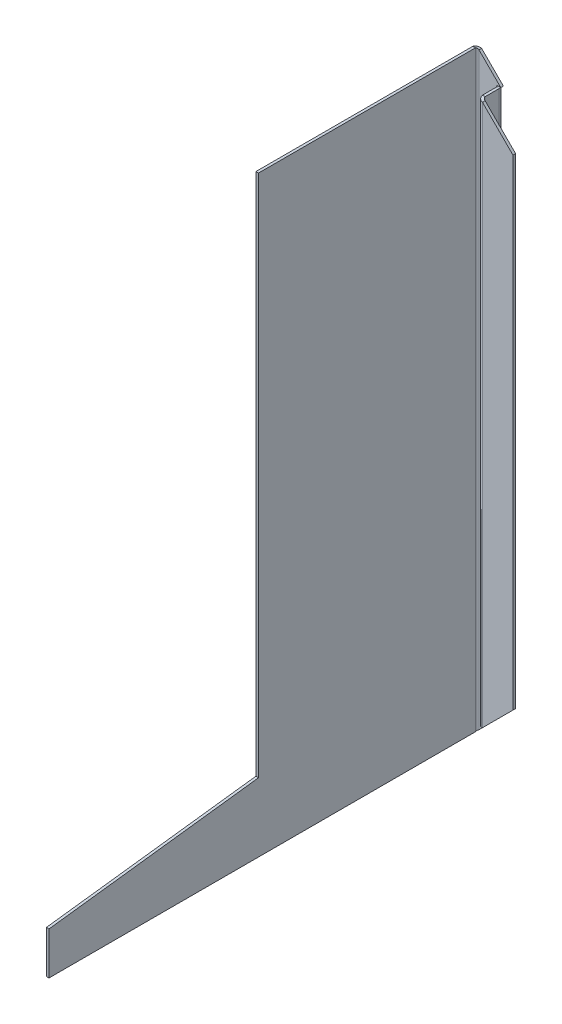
ISO-10303-21;
HEADER;
FILE_DESCRIPTION(('STEP AP214'),'2;1');
FILE_NAME('part.step','',(''),(''),'','','');
FILE_SCHEMA(('AUTOMOTIVE_DESIGN { 1 0 10303 214 1 1 1 1 }'));
ENDSEC;
DATA;
#1=APPLICATION_CONTEXT('core data for automotive mechanical design processes');
#2=APPLICATION_PROTOCOL_DEFINITION('international standard','automotive_design',2000,#1);
#3=PRODUCT_CONTEXT('',#1,'mechanical');
#4=PRODUCT('Part','Part','',(#3));
#5=PRODUCT_RELATED_PRODUCT_CATEGORY('part','',(#4));
#6=PRODUCT_DEFINITION_FORMATION('','',#4);
#7=PRODUCT_DEFINITION_CONTEXT('part definition',#1,'design');
#8=PRODUCT_DEFINITION('design','',#6,#7);
#9=PRODUCT_DEFINITION_SHAPE('','',#8);
#10=(LENGTH_UNIT() NAMED_UNIT(*) SI_UNIT(.MILLI.,.METRE.));
#11=(NAMED_UNIT(*) PLANE_ANGLE_UNIT() SI_UNIT($,.RADIAN.));
#12=(NAMED_UNIT(*) SI_UNIT($,.STERADIAN.) SOLID_ANGLE_UNIT());
#13=UNCERTAINTY_MEASURE_WITH_UNIT(LENGTH_MEASURE(1.E-05),#10,'distance_accuracy_value','');
#14=(GEOMETRIC_REPRESENTATION_CONTEXT(3) GLOBAL_UNCERTAINTY_ASSIGNED_CONTEXT((#13)) GLOBAL_UNIT_ASSIGNED_CONTEXT((#10,
#11,#12)) REPRESENTATION_CONTEXT('',''));
#15=CARTESIAN_POINT('',(0.,0.,0.));
#16=DIRECTION('',(0.,0.,1.));
#17=DIRECTION('',(1.,0.,0.));
#18=AXIS2_PLACEMENT_3D('',#15,#16,#17);
#19=CARTESIAN_POINT('',(13.5000000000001,325.75,-234.5));
#20=DIRECTION('',(0.,-1.,0.));
#21=DIRECTION('',(1.,0.,0.));
#22=AXIS2_PLACEMENT_3D('',#19,#20,#21);
#23=PLANE('',#22);
#24=DIRECTION('',(-1.,0.,0.));
#25=VECTOR('',#24,1.);
#26=CARTESIAN_POINT('',(13.5,325.75,-237.));
#27=LINE('',#26,#25);
#28=CARTESIAN_POINT('',(13.5,325.75,-237.));
#29=VERTEX_POINT('',#28);
#30=CARTESIAN_POINT('',(12.0000000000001,325.75,-237.));
#31=VERTEX_POINT('',#30);
#32=EDGE_CURVE('E299',#29,#31,#27,.T.);
#33=ORIENTED_EDGE('',*,*,#32,.F.);
#34=DIRECTION('',(0.,0.,1.));
#35=VECTOR('',#34,1.);
#36=CARTESIAN_POINT('',(13.5,325.75,-246.));
#37=LINE('',#36,#35);
#38=CARTESIAN_POINT('',(13.5,325.75,-245.));
#39=VERTEX_POINT('',#38);
#40=EDGE_CURVE('E646',#39,#29,#37,.T.);
#41=ORIENTED_EDGE('',*,*,#40,.F.);
#42=DIRECTION('',(-1.,0.,0.));
#43=VECTOR('',#42,1.);
#44=CARTESIAN_POINT('',(12.,325.75,-245.));
#45=LINE('',#44,#43);
#46=CARTESIAN_POINT('',(12.,325.75,-245.));
#47=VERTEX_POINT('',#46);
#48=EDGE_CURVE('E608',#47,#39,#45,.F.);
#49=ORIENTED_EDGE('',*,*,#48,.F.);
#50=DIRECTION('',(0.,0.,-1.));
#51=VECTOR('',#50,1.);
#52=CARTESIAN_POINT('',(12.0000000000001,325.75,-234.5));
#53=LINE('',#52,#51);
#54=EDGE_CURVE('E634',#47,#31,#53,.F.);
#55=ORIENTED_EDGE('',*,*,#54,.T.);
#56=EDGE_LOOP('',(#33,#41,#49,#55));
#57=FACE_BOUND('',#56,.T.);
#58=ADVANCED_FACE('F101',(#57),#23,.F.);
#59=CARTESIAN_POINT('',(13.5,13.5000000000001,-246.));
#60=DIRECTION('',(0.,1.,0.));
#61=DIRECTION('',(0.,0.,1.));
#62=AXIS2_PLACEMENT_3D('',#59,#60,#61);
#63=PLANE('',#62);
#64=DIRECTION('',(-1.,0.,0.));
#65=VECTOR('',#64,1.);
#66=CARTESIAN_POINT('',(13.5,13.5000000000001,-237.));
#67=LINE('',#66,#65);
#68=CARTESIAN_POINT('',(13.5,13.5000000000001,-237.));
#69=VERTEX_POINT('',#68);
#70=CARTESIAN_POINT('',(12.,13.5000000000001,-237.));
#71=VERTEX_POINT('',#70);
#72=EDGE_CURVE('E302',#69,#71,#67,.T.);
#73=ORIENTED_EDGE('',*,*,#72,.T.);
#74=DIRECTION('',(0.,0.,1.));
#75=VECTOR('',#74,1.);
#76=CARTESIAN_POINT('',(12.,13.5000000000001,-246.));
#77=LINE('',#76,#75);
#78=CARTESIAN_POINT('',(12.,13.5000000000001,-245.));
#79=VERTEX_POINT('',#78);
#80=EDGE_CURVE('E638',#71,#79,#77,.F.);
#81=ORIENTED_EDGE('',*,*,#80,.T.);
#82=DIRECTION('',(-1.,0.,0.));
#83=VECTOR('',#82,1.);
#84=CARTESIAN_POINT('',(13.5,13.5000000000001,-245.));
#85=LINE('',#84,#83);
#86=CARTESIAN_POINT('',(13.5,13.5000000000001,-245.));
#87=VERTEX_POINT('',#86);
#88=EDGE_CURVE('E301',#79,#87,#85,.F.);
#89=ORIENTED_EDGE('',*,*,#88,.T.);
#90=DIRECTION('',(0.,0.,-1.));
#91=VECTOR('',#90,1.);
#92=CARTESIAN_POINT('',(13.5,13.5000000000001,-246.));
#93=LINE('',#92,#91);
#94=EDGE_CURVE('E343',#69,#87,#93,.T.);
#95=ORIENTED_EDGE('',*,*,#94,.F.);
#96=EDGE_LOOP('',(#73,#81,#89,#95));
#97=FACE_BOUND('',#96,.T.);
#98=ADVANCED_FACE('F361',(#97),#63,.F.);
#99=CARTESIAN_POINT('',(13.5,325.75,-246.));
#100=DIRECTION('',(-1.,0.,0.));
#101=DIRECTION('',(0.,0.,1.));
#102=AXIS2_PLACEMENT_3D('',#99,#100,#101);
#103=PLANE('',#102);
#104=DIRECTION('',(0.,-1.,0.));
#105=VECTOR('',#104,1.);
#106=CARTESIAN_POINT('',(13.5,13.5000000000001,-237.));
#107=LINE('',#106,#105);
#108=EDGE_CURVE('E291',#69,#29,#107,.F.);
#109=ORIENTED_EDGE('',*,*,#108,.F.);
#110=ORIENTED_EDGE('',*,*,#94,.T.);
#111=DIRECTION('',(0.,1.,0.));
#112=VECTOR('',#111,1.);
#113=CARTESIAN_POINT('',(13.5,13.5000000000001,-245.));
#114=LINE('',#113,#112);
#115=EDGE_CURVE('E631',#39,#87,#114,.F.);
#116=ORIENTED_EDGE('',*,*,#115,.F.);
#117=ORIENTED_EDGE('',*,*,#40,.T.);
#118=EDGE_LOOP('',(#109,#110,#116,#117));
#119=FACE_BOUND('',#118,.T.);
#120=ADVANCED_FACE('F351',(#119),#103,.F.);
#121=CARTESIAN_POINT('',(12.,325.75,-246.));
#122=DIRECTION('',(-1.,0.,0.));
#123=DIRECTION('',(0.,0.,1.));
#124=AXIS2_PLACEMENT_3D('',#121,#122,#123);
#125=PLANE('',#124);
#126=ORIENTED_EDGE('',*,*,#80,.F.);
#127=DIRECTION('',(0.,-1.,0.));
#128=VECTOR('',#127,1.);
#129=CARTESIAN_POINT('',(12.,13.5000000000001,-237.));
#130=LINE('',#129,#128);
#131=EDGE_CURVE('E295',#71,#31,#130,.F.);
#132=ORIENTED_EDGE('',*,*,#131,.T.);
#133=ORIENTED_EDGE('',*,*,#54,.F.);
#134=DIRECTION('',(0.,1.,0.));
#135=VECTOR('',#134,1.);
#136=CARTESIAN_POINT('',(12.,13.5000000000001,-245.));
#137=LINE('',#136,#135);
#138=EDGE_CURVE('E639',#79,#47,#137,.T.);
#139=ORIENTED_EDGE('',*,*,#138,.F.);
#140=EDGE_LOOP('',(#126,#132,#133,#139));
#141=FACE_BOUND('',#140,.T.);
#142=ADVANCED_FACE('F360',(#141),#125,.T.);
#143=CARTESIAN_POINT('',(13.5,325.75,-246.));
#144=DIRECTION('',(0.,-1.,0.));
#145=DIRECTION('',(0.,0.,-1.));
#146=AXIS2_PLACEMENT_3D('',#143,#144,#145);
#147=PLANE('',#146);
#148=DIRECTION('',(-1.,0.,0.));
#149=VECTOR('',#148,1.);
#150=CARTESIAN_POINT('',(13.5,325.75,-246.));
#151=LINE('',#150,#149);
#152=CARTESIAN_POINT('',(13.5,325.75,-246.));
#153=VERTEX_POINT('',#152);
#154=CARTESIAN_POINT('',(13.2912878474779,325.75,-246.));
#155=VERTEX_POINT('',#154);
#156=EDGE_CURVE('E575',#153,#155,#151,.T.);
#157=ORIENTED_EDGE('',*,*,#156,.T.);
#158=CARTESIAN_POINT('',(11.,325.75,-245.));
#159=DIRECTION('',(0.,1.,0.));
#160=DIRECTION('',(0.,0.,1.));
#161=AXIS2_PLACEMENT_3D('',#158,#159,#160);
#162=CIRCLE('',#161,2.49999999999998);
#163=CARTESIAN_POINT('',(11.,325.75,-247.5));
#164=VERTEX_POINT('',#163);
#165=EDGE_CURVE('E13',#155,#164,#162,.T.);
#166=ORIENTED_EDGE('',*,*,#165,.T.);
#167=DIRECTION('',(1.,0.,0.));
#168=VECTOR('',#167,1.);
#169=CARTESIAN_POINT('',(0.,325.75,-247.5));
#170=LINE('',#169,#168);
#171=CARTESIAN_POINT('',(13.5,325.75,-247.5));
#172=VERTEX_POINT('',#171);
#173=EDGE_CURVE('E582',#164,#172,#170,.T.);
#174=ORIENTED_EDGE('',*,*,#173,.T.);
#175=DIRECTION('',(0.,0.,1.));
#176=VECTOR('',#175,1.);
#177=CARTESIAN_POINT('',(13.5,325.75,-247.5));
#178=LINE('',#177,#176);
#179=EDGE_CURVE('E467',#172,#153,#178,.T.);
#180=ORIENTED_EDGE('',*,*,#179,.T.);
#181=EDGE_LOOP('',(#157,#166,#174,#180));
#182=FACE_BOUND('',#181,.T.);
#183=ADVANCED_FACE('F365',(#182),#147,.T.);
#184=CARTESIAN_POINT('',(11.,13.5000000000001,-246.));
#185=DIRECTION('',(0.,1.,0.));
#186=DIRECTION('',(0.,0.,1.));
#187=AXIS2_PLACEMENT_3D('',#184,#185,#186);
#188=PLANE('',#187);
#189=DIRECTION('',(-1.,0.,0.));
#190=VECTOR('',#189,1.);
#191=CARTESIAN_POINT('',(-1.81351297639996E-12,13.5000000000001,-247.5));
#192=LINE('',#191,#190);
#193=CARTESIAN_POINT('',(13.5,13.5000000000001,-247.5));
#194=VERTEX_POINT('',#193);
#195=CARTESIAN_POINT('',(11.,13.5000000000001,-247.5));
#196=VERTEX_POINT('',#195);
#197=EDGE_CURVE('E585',#194,#196,#192,.T.);
#198=ORIENTED_EDGE('',*,*,#197,.T.);
#199=CARTESIAN_POINT('',(11.,13.5000000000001,-245.));
#200=DIRECTION('',(0.,1.,0.));
#201=DIRECTION('',(0.,0.,1.));
#202=AXIS2_PLACEMENT_3D('',#199,#200,#201);
#203=CIRCLE('',#202,2.49999999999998);
#204=CARTESIAN_POINT('',(13.2912878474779,13.5000000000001,-246.));
#205=VERTEX_POINT('',#204);
#206=EDGE_CURVE('E617',#196,#205,#203,.F.);
#207=ORIENTED_EDGE('',*,*,#206,.T.);
#208=DIRECTION('',(1.,0.,0.));
#209=VECTOR('',#208,1.);
#210=CARTESIAN_POINT('',(11.,13.5000000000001,-246.));
#211=LINE('',#210,#209);
#212=CARTESIAN_POINT('',(13.5,13.5000000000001,-246.));
#213=VERTEX_POINT('',#212);
#214=EDGE_CURVE('E624',#205,#213,#211,.T.);
#215=ORIENTED_EDGE('',*,*,#214,.T.);
#216=DIRECTION('',(0.,0.,1.));
#217=VECTOR('',#216,1.);
#218=CARTESIAN_POINT('',(13.5,13.5000000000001,-247.5));
#219=LINE('',#218,#217);
#220=EDGE_CURVE('E592',#194,#213,#219,.T.);
#221=ORIENTED_EDGE('',*,*,#220,.F.);
#222=EDGE_LOOP('',(#198,#207,#215,#221));
#223=FACE_BOUND('',#222,.T.);
#224=ADVANCED_FACE('F390',(#223),#188,.T.);
#225=CARTESIAN_POINT('',(0.,339.25,-247.5));
#226=DIRECTION('',(0.,0.,1.));
#227=DIRECTION('',(1.,0.,0.));
#228=AXIS2_PLACEMENT_3D('',#225,#226,#227);
#229=PLANE('',#228);
#230=ORIENTED_EDGE('',*,*,#173,.F.);
#231=DIRECTION('',(0.,1.,0.));
#232=VECTOR('',#231,1.);
#233=CARTESIAN_POINT('',(11.,325.75,-247.5));
#234=LINE('',#233,#232);
#235=EDGE_CURVE('E604',#164,#196,#234,.F.);
#236=ORIENTED_EDGE('',*,*,#235,.T.);
#237=ORIENTED_EDGE('',*,*,#197,.F.);
#238=DIRECTION('',(-0.707106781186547,-0.707106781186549,0.));
#239=VECTOR('',#238,1.);
#240=CARTESIAN_POINT('',(169.625,169.625000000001,-247.500000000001));
#241=LINE('',#240,#239);
#242=CARTESIAN_POINT('',(0.999999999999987,1.00000000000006,-247.5));
#243=VERTEX_POINT('',#242);
#244=EDGE_CURVE('E595',#194,#243,#241,.T.);
#245=ORIENTED_EDGE('',*,*,#244,.T.);
#246=DIRECTION('',(0.,1.,0.));
#247=VECTOR('',#246,1.);
#248=CARTESIAN_POINT('',(1.,1.00000000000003,-247.5));
#249=LINE('',#248,#247);
#250=CARTESIAN_POINT('',(0.999999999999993,338.25,-247.5));
#251=VERTEX_POINT('',#250);
#252=EDGE_CURVE('E571',#251,#243,#249,.F.);
#253=ORIENTED_EDGE('',*,*,#252,.F.);
#254=DIRECTION('',(0.707106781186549,-0.707106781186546,0.));
#255=VECTOR('',#254,1.);
#256=CARTESIAN_POINT('',(0.,339.25,-247.5));
#257=LINE('',#256,#255);
#258=EDGE_CURVE('E570',#251,#172,#257,.T.);
#259=ORIENTED_EDGE('',*,*,#258,.T.);
#260=EDGE_LOOP('',(#230,#236,#237,#245,#253,#259));
#261=FACE_BOUND('',#260,.T.);
#262=ADVANCED_FACE('F393',(#261),#229,.F.);
#263=CARTESIAN_POINT('',(0.,339.25,-246.));
#264=DIRECTION('',(0.,0.,1.));
#265=DIRECTION('',(1.,0.,0.));
#266=AXIS2_PLACEMENT_3D('',#263,#264,#265);
#267=PLANE('',#266);
#268=DIRECTION('',(0.,1.,0.));
#269=VECTOR('',#268,1.);
#270=CARTESIAN_POINT('',(11.,325.75,-246.));
#271=LINE('',#270,#269);
#272=CARTESIAN_POINT('',(11.,325.75,-246.));
#273=VERTEX_POINT('',#272);
#274=CARTESIAN_POINT('',(11.,13.5000000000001,-246.));
#275=VERTEX_POINT('',#274);
#276=EDGE_CURVE('E614',#273,#275,#271,.F.);
#277=ORIENTED_EDGE('',*,*,#276,.F.);
#278=EDGE_CURVE('E127',#155,#273,#151,.T.);
#279=ORIENTED_EDGE('',*,*,#278,.F.);
#280=ORIENTED_EDGE('',*,*,#156,.F.);
#281=DIRECTION('',(-0.707106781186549,0.707106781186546,0.));
#282=VECTOR('',#281,1.);
#283=CARTESIAN_POINT('',(13.5,325.75,-246.));
#284=LINE('',#283,#282);
#285=CARTESIAN_POINT('',(0.999999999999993,338.25,-246.));
#286=VERTEX_POINT('',#285);
#287=EDGE_CURVE('E568',#286,#153,#284,.F.);
#288=ORIENTED_EDGE('',*,*,#287,.F.);
#289=DIRECTION('',(0.,1.,0.));
#290=VECTOR('',#289,1.);
#291=CARTESIAN_POINT('',(1.,1.00000000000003,-246.));
#292=LINE('',#291,#290);
#293=CARTESIAN_POINT('',(0.999999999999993,1.00000000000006,-246.));
#294=VERTEX_POINT('',#293);
#295=EDGE_CURVE('E559',#294,#286,#292,.T.);
#296=ORIENTED_EDGE('',*,*,#295,.F.);
#297=DIRECTION('',(0.707106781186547,0.707106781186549,0.));
#298=VECTOR('',#297,1.);
#299=CARTESIAN_POINT('',(0.,0.,-246.));
#300=LINE('',#299,#298);
#301=EDGE_CURVE('E576',#213,#294,#300,.F.);
#302=ORIENTED_EDGE('',*,*,#301,.F.);
#303=ORIENTED_EDGE('',*,*,#214,.F.);
#304=EDGE_CURVE('E622',#275,#205,#211,.T.);
#305=ORIENTED_EDGE('',*,*,#304,.F.);
#306=EDGE_LOOP('',(#277,#279,#280,#288,#296,#302,#303,#305));
#307=FACE_BOUND('',#306,.T.);
#308=ADVANCED_FACE('F400',(#307),#267,.T.);
#309=CARTESIAN_POINT('',(-1.5,339.25,-120.75));
#310=DIRECTION('',(0.,1.,0.));
#311=DIRECTION('',(0.,0.,1.));
#312=AXIS2_PLACEMENT_3D('',#309,#310,#311);
#313=PLANE('',#312);
#314=DIRECTION('',(0.,0.,1.));
#315=VECTOR('',#314,1.);
#316=CARTESIAN_POINT('',(0.,339.25,-120.75));
#317=LINE('',#316,#315);
#318=CARTESIAN_POINT('',(0.,339.25,-245.));
#319=VERTEX_POINT('',#318);
#320=CARTESIAN_POINT('',(0.,339.25,-120.75));
#321=VERTEX_POINT('',#320);
#322=EDGE_CURVE('E489',#319,#321,#317,.T.);
#323=ORIENTED_EDGE('',*,*,#322,.F.);
#324=DIRECTION('',(-1.,0.,0.));
#325=VECTOR('',#324,1.);
#326=CARTESIAN_POINT('',(0.,339.25,-245.));
#327=LINE('',#326,#325);
#328=CARTESIAN_POINT('',(-1.50000000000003,339.25,-245.));
#329=VERTEX_POINT('',#328);
#330=EDGE_CURVE('E544',#319,#329,#327,.T.);
#331=ORIENTED_EDGE('',*,*,#330,.T.);
#332=DIRECTION('',(0.,0.,1.));
#333=VECTOR('',#332,1.);
#334=CARTESIAN_POINT('',(-1.5,339.25,-246.75));
#335=LINE('',#334,#333);
#336=CARTESIAN_POINT('',(-1.5,339.25,-120.75));
#337=VERTEX_POINT('',#336);
#338=EDGE_CURVE('E477',#329,#337,#335,.T.);
#339=ORIENTED_EDGE('',*,*,#338,.T.);
#340=DIRECTION('',(1.,0.,0.));
#341=VECTOR('',#340,1.);
#342=CARTESIAN_POINT('',(-1.5,339.25,-120.75));
#343=LINE('',#342,#341);
#344=EDGE_CURVE('E502',#337,#321,#343,.T.);
#345=ORIENTED_EDGE('',*,*,#344,.T.);
#346=EDGE_LOOP('',(#323,#331,#339,#345));
#347=FACE_BOUND('',#346,.T.);
#348=ADVANCED_FACE('F404',(#347),#313,.T.);
#349=CARTESIAN_POINT('',(-1.5,0.,-0.750000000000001));
#350=DIRECTION('',(-1.,0.,0.));
#351=DIRECTION('',(0.,0.,1.));
#352=AXIS2_PLACEMENT_3D('',#349,#350,#351);
#353=PLANE('',#352);
#354=ORIENTED_EDGE('',*,*,#338,.F.);
#355=DIRECTION('',(0.,1.,0.));
#356=VECTOR('',#355,1.);
#357=CARTESIAN_POINT('',(-1.50000000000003,339.25,-245.));
#358=LINE('',#357,#356);
#359=CARTESIAN_POINT('',(-1.5,0.,-245.));
#360=VERTEX_POINT('',#359);
#361=EDGE_CURVE('E437',#329,#360,#358,.F.);
#362=ORIENTED_EDGE('',*,*,#361,.T.);
#363=DIRECTION('',(0.,0.,-1.));
#364=VECTOR('',#363,1.);
#365=CARTESIAN_POINT('',(-1.5,0.,-247.5));
#366=LINE('',#365,#364);
#367=CARTESIAN_POINT('',(-1.5,0.,-0.75));
#368=VERTEX_POINT('',#367);
#369=EDGE_CURVE('E472',#368,#360,#366,.T.);
#370=ORIENTED_EDGE('',*,*,#369,.F.);
#371=DIRECTION('',(0.,-1.,0.));
#372=VECTOR('',#371,1.);
#373=CARTESIAN_POINT('',(-1.5,0.750000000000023,-0.75));
#374=LINE('',#373,#372);
#375=CARTESIAN_POINT('',(-1.5,24.337913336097,-0.75));
#376=VERTEX_POINT('',#375);
#377=EDGE_CURVE('E468',#376,#368,#374,.T.);
#378=ORIENTED_EDGE('',*,*,#377,.F.);
#379=DIRECTION('',(0.,-0.124034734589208,0.992277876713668));
#380=VECTOR('',#379,1.);
#381=CARTESIAN_POINT('',(-1.5,24.337913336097,-0.75));
#382=LINE('',#381,#380);
#383=CARTESIAN_POINT('',(-1.5,39.337913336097,-120.75));
#384=VERTEX_POINT('',#383);
#385=EDGE_CURVE('E482',#384,#376,#382,.T.);
#386=ORIENTED_EDGE('',*,*,#385,.F.);
#387=DIRECTION('',(0.,-1.,0.));
#388=VECTOR('',#387,1.);
#389=CARTESIAN_POINT('',(-1.5,39.337913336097,-120.75));
#390=LINE('',#389,#388);
#391=EDGE_CURVE('E479',#337,#384,#390,.T.);
#392=ORIENTED_EDGE('',*,*,#391,.F.);
#393=EDGE_LOOP('',(#354,#362,#370,#378,#386,#392));
#394=FACE_BOUND('',#393,.T.);
#395=ADVANCED_FACE('F452',(#394),#353,.T.);
#396=CARTESIAN_POINT('',(0.,0.,-0.750000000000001));
#397=DIRECTION('',(-1.,0.,0.));
#398=DIRECTION('',(0.,0.,1.));
#399=AXIS2_PLACEMENT_3D('',#396,#397,#398);
#400=PLANE('',#399);
#401=DIRECTION('',(0.,1.,0.));
#402=VECTOR('',#401,1.);
#403=CARTESIAN_POINT('',(0.,339.25,-245.));
#404=LINE('',#403,#402);
#405=CARTESIAN_POINT('',(0.,0.,-245.));
#406=VERTEX_POINT('',#405);
#407=EDGE_CURVE('E466',#319,#406,#404,.F.);
#408=ORIENTED_EDGE('',*,*,#407,.F.);
#409=ORIENTED_EDGE('',*,*,#322,.T.);
#410=DIRECTION('',(0.,-1.,0.));
#411=VECTOR('',#410,1.);
#412=CARTESIAN_POINT('',(0.,39.337913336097,-120.75));
#413=LINE('',#412,#411);
#414=CARTESIAN_POINT('',(0.,39.337913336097,-120.75));
#415=VERTEX_POINT('',#414);
#416=EDGE_CURVE('E492',#321,#415,#413,.T.);
#417=ORIENTED_EDGE('',*,*,#416,.T.);
#418=DIRECTION('',(0.,-0.124034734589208,0.992277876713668));
#419=VECTOR('',#418,1.);
#420=CARTESIAN_POINT('',(0.,24.337913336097,-0.75));
#421=LINE('',#420,#419);
#422=CARTESIAN_POINT('',(0.,24.337913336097,-0.75));
#423=VERTEX_POINT('',#422);
#424=EDGE_CURVE('E495',#415,#423,#421,.T.);
#425=ORIENTED_EDGE('',*,*,#424,.T.);
#426=DIRECTION('',(0.,-1.,0.));
#427=VECTOR('',#426,1.);
#428=CARTESIAN_POINT('',(0.,0.750000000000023,-0.75));
#429=LINE('',#428,#427);
#430=CARTESIAN_POINT('',(0.,0.,-0.75));
#431=VERTEX_POINT('',#430);
#432=EDGE_CURVE('E473',#423,#431,#429,.T.);
#433=ORIENTED_EDGE('',*,*,#432,.T.);
#434=DIRECTION('',(0.,0.,-1.));
#435=VECTOR('',#434,1.);
#436=CARTESIAN_POINT('',(0.,0.,-247.5));
#437=LINE('',#436,#435);
#438=EDGE_CURVE('E485',#431,#406,#437,.T.);
#439=ORIENTED_EDGE('',*,*,#438,.T.);
#440=EDGE_LOOP('',(#408,#409,#417,#425,#433,#439));
#441=FACE_BOUND('',#440,.T.);
#442=ADVANCED_FACE('F521',(#441),#400,.F.);
#443=CARTESIAN_POINT('',(-1.5,0.750000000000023,-0.75));
#444=DIRECTION('',(0.,0.,1.));
#445=DIRECTION('',(1.,0.,0.));
#446=AXIS2_PLACEMENT_3D('',#443,#444,#445);
#447=PLANE('',#446);
#448=ORIENTED_EDGE('',*,*,#432,.F.);
#449=DIRECTION('',(1.,0.,0.));
#450=VECTOR('',#449,1.);
#451=CARTESIAN_POINT('',(-1.5,24.337913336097,-0.75));
#452=LINE('',#451,#450);
#453=EDGE_CURVE('E110',#376,#423,#452,.T.);
#454=ORIENTED_EDGE('',*,*,#453,.F.);
#455=ORIENTED_EDGE('',*,*,#377,.T.);
#456=DIRECTION('',(1.,0.,0.));
#457=VECTOR('',#456,1.);
#458=CARTESIAN_POINT('',(-1.5,0.,-0.75));
#459=LINE('',#458,#457);
#460=EDGE_CURVE('E105',#368,#431,#459,.T.);
#461=ORIENTED_EDGE('',*,*,#460,.T.);
#462=EDGE_LOOP('',(#448,#454,#455,#461));
#463=FACE_BOUND('',#462,.T.);
#464=ADVANCED_FACE('F513',(#463),#447,.T.);
#465=CARTESIAN_POINT('',(-1.5,24.337913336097,-0.75));
#466=DIRECTION('',(0.,0.992277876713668,0.124034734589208));
#467=DIRECTION('',(0.,-0.124034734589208,0.992277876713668));
#468=AXIS2_PLACEMENT_3D('',#465,#466,#467);
#469=PLANE('',#468);
#470=ORIENTED_EDGE('',*,*,#424,.F.);
#471=DIRECTION('',(1.,0.,0.));
#472=VECTOR('',#471,1.);
#473=CARTESIAN_POINT('',(-1.5,39.337913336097,-120.75));
#474=LINE('',#473,#472);
#475=EDGE_CURVE('E501',#384,#415,#474,.T.);
#476=ORIENTED_EDGE('',*,*,#475,.F.);
#477=ORIENTED_EDGE('',*,*,#385,.T.);
#478=ORIENTED_EDGE('',*,*,#453,.T.);
#479=EDGE_LOOP('',(#470,#476,#477,#478));
#480=FACE_BOUND('',#479,.T.);
#481=ADVANCED_FACE('F524',(#480),#469,.T.);
#482=CARTESIAN_POINT('',(-1.5,39.337913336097,-120.75));
#483=DIRECTION('',(0.,0.,1.));
#484=DIRECTION('',(1.,0.,0.));
#485=AXIS2_PLACEMENT_3D('',#482,#483,#484);
#486=PLANE('',#485);
#487=ORIENTED_EDGE('',*,*,#416,.F.);
#488=ORIENTED_EDGE('',*,*,#344,.F.);
#489=ORIENTED_EDGE('',*,*,#391,.T.);
#490=ORIENTED_EDGE('',*,*,#475,.T.);
#491=EDGE_LOOP('',(#487,#488,#489,#490));
#492=FACE_BOUND('',#491,.T.);
#493=ADVANCED_FACE('F530',(#492),#486,.T.);
#494=CARTESIAN_POINT('',(-1.5,0.,-247.5));
#495=DIRECTION('',(0.,-1.,0.));
#496=DIRECTION('',(0.,0.,-1.));
#497=AXIS2_PLACEMENT_3D('',#494,#495,#496);
#498=PLANE('',#497);
#499=DIRECTION('',(-1.,0.,0.));
#500=VECTOR('',#499,1.);
#501=CARTESIAN_POINT('',(0.,0.,-245.));
#502=LINE('',#501,#500);
#503=EDGE_CURVE('E490',#406,#360,#502,.T.);
#504=ORIENTED_EDGE('',*,*,#503,.F.);
#505=ORIENTED_EDGE('',*,*,#438,.F.);
#506=ORIENTED_EDGE('',*,*,#460,.F.);
#507=ORIENTED_EDGE('',*,*,#369,.T.);
#508=EDGE_LOOP('',(#504,#505,#506,#507));
#509=FACE_BOUND('',#508,.T.);
#510=ADVANCED_FACE('F103',(#509),#498,.T.);
#511=CARTESIAN_POINT('',(-1.51500000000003,0.,-245.));
#512=CARTESIAN_POINT('',(-1.51500000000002,0.0833474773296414,-245.329268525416));
#513=CARTESIAN_POINT('',(-1.44954128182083,0.166666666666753,-245.658295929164));
#514=CARTESIAN_POINT('',(-1.19757276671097,0.333333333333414,-246.266601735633));
#515=CARTESIAN_POINT('',(-1.01116210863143,0.416666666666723,-246.545585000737));
#516=CARTESIAN_POINT('',(-0.545585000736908,0.583333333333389,-247.011162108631));
#517=CARTESIAN_POINT('',(-0.266601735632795,0.666666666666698,-247.197572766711));
#518=CARTESIAN_POINT('',(0.341704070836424,0.833333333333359,-247.449541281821));
#519=CARTESIAN_POINT('',(0.670731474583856,0.916652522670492,-247.515));
#520=CARTESIAN_POINT('',(1.00000000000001,1.00000000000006,-247.515));
#521=CARTESIAN_POINT('',(-1.50000000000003,0.,-245.));
#522=CARTESIAN_POINT('',(-1.50000000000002,0.0833474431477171,-245.32730464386));
#523=CARTESIAN_POINT('',(-1.43493169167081,0.166666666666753,-245.654369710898));
#524=CARTESIAN_POINT('',(-1.18446597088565,0.333333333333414,-246.259047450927));
#525=CARTESIAN_POINT('',(-0.999167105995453,0.416666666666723,-246.536366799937));
#526=CARTESIAN_POINT('',(-0.536366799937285,0.583333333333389,-246.999167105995));
#527=CARTESIAN_POINT('',(-0.259047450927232,0.666666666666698,-247.184465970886));
#528=CARTESIAN_POINT('',(0.345630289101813,0.833333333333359,-247.434931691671));
#529=CARTESIAN_POINT('',(0.672695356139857,0.916652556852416,-247.5));
#530=CARTESIAN_POINT('',(1.00000000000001,1.00000000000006,-247.5));
#531=CARTESIAN_POINT('',(0.,0.,-245.));
#532=CARTESIAN_POINT('',(0.,0.0833440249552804,-245.13091648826));
#533=CARTESIAN_POINT('',(0.0260273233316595,0.166666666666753,-245.261747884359));
#534=CARTESIAN_POINT('',(0.126213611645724,0.333333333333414,-245.503618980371));
#535=CARTESIAN_POINT('',(0.200333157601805,0.416666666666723,-245.614546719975));
#536=CARTESIAN_POINT('',(0.385453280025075,0.583333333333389,-245.799666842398));
#537=CARTESIAN_POINT('',(0.496381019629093,0.666666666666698,-245.873786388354));
#538=CARTESIAN_POINT('',(0.738252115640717,0.833333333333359,-245.973972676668));
#539=CARTESIAN_POINT('',(0.869083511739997,0.916655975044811,-246.));
#540=CARTESIAN_POINT('',(1.,1.00000000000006,-246.));
#541=CARTESIAN_POINT('',(0.0151499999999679,0.,-245.));
#542=CARTESIAN_POINT('',(0.0151499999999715,0.0833439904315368,-245.128932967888));
#543=CARTESIAN_POINT('',(0.0407830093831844,0.166666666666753,-245.257782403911));
#544=CARTESIAN_POINT('',(0.139451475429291,0.333333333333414,-245.495989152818));
#545=CARTESIAN_POINT('',(0.212448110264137,0.416666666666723,-245.605236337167));
#546=CARTESIAN_POINT('',(0.394763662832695,0.583333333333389,-245.787551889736));
#547=CARTESIAN_POINT('',(0.504010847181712,0.666666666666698,-245.860548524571));
#548=CARTESIAN_POINT('',(0.74221759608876,0.833333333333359,-245.959216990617));
#549=CARTESIAN_POINT('',(0.871067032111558,0.916656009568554,-245.98485));
#550=CARTESIAN_POINT('',(1.,1.00000000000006,-245.98485));
#551=B_SPLINE_SURFACE_WITH_KNOTS('',1,3,((#511,#512,#513,#514,#515,#516,#517,#518,#519,#520),
(#521,#522,#523,#524,#525,#526,#527,#528,#529,#530),(#531,#532,#533,#534,#535,#536,#537,#538,
#539,#540),(#541,#542,#543,#544,#545,#546,#547,#548,#549,#550)),.UNSPECIFIED.,.F.,.F.,.F.,(2,1,
1,2),(4,2,2,2,4),(-0.01,0.,1.,1.0101),(0.,0.25,0.5,0.75,1.),.UNSPECIFIED.);
#552=DIRECTION('',(0.,0.,1.));
#553=VECTOR('',#552,1.);
#554=CARTESIAN_POINT('',(1.,1.00000000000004,-247.5));
#555=LINE('',#554,#553);
#556=EDGE_CURVE('E556',#294,#243,#555,.F.);
#557=CARTESIAN_POINT('',(0.,0.,-245.));
#558=CARTESIAN_POINT('',(-7.59315883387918E-06,0.0228958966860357,-245.035962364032));
#559=CARTESIAN_POINT('',(0.00193976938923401,0.0457898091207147,-245.071923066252));
#560=CARTESIAN_POINT('',(0.00968794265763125,0.0915761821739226,-245.143426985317));
#561=CARTESIAN_POINT('',(0.0154886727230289,0.114468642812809,-245.178970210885));
#562=CARTESIAN_POINT('',(0.0308756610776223,0.160221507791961,-245.249174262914));
#563=CARTESIAN_POINT('',(0.0404562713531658,0.183081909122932,-245.283836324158));
#564=CARTESIAN_POINT('',(0.0632799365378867,0.228795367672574,-245.351918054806));
#565=CARTESIAN_POINT('',(0.0765226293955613,0.251648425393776,-245.385337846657));
#566=CARTESIAN_POINT('',(0.119435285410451,0.317000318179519,-245.478590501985));
#567=CARTESIAN_POINT('',(0.153449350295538,0.359526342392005,-245.536474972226));
#568=CARTESIAN_POINT('',(0.232277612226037,0.444535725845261,-245.644254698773));
#569=CARTESIAN_POINT('',(0.277085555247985,0.487019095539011,-245.694154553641));
#570=CARTESIAN_POINT('',(0.37573000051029,0.571984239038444,-245.784051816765));
#571=CARTESIAN_POINT('',(0.429565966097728,0.61446601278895,-245.824049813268));
#572=CARTESIAN_POINT('',(0.544140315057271,0.699449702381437,-245.892551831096));
#573=CARTESIAN_POINT('',(0.604880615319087,0.741951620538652,-245.921052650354));
#574=CARTESIAN_POINT('',(0.721086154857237,0.820384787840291,-245.961973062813));
#575=CARTESIAN_POINT('',(0.775923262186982,0.856319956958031,-245.976193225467));
#576=CARTESIAN_POINT('',(0.887165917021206,0.92816659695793,-245.995225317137));
#577=CARTESIAN_POINT('',(0.943570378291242,0.964078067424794,-246.00004360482));
#578=CARTESIAN_POINT('',(1.,1.00000000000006,-246.));
#579=B_SPLINE_CURVE_WITH_KNOTS('',3,(#557,#558,#559,#560,#561,#562,#563,#564,#565,#566,#567,
#568,#569,#570,#571,#572,#573,#574,#575,#576,#577,#578),.UNSPECIFIED.,.F.,.F.,(4,2,2,2,2,2,2,2,
2,2,4),(0.,0.127848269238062,0.255693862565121,0.383349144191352,0.510991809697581,
0.748186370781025,0.98524382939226,1.22228720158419,1.45939654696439,1.65999150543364,
1.8604507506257),.UNSPECIFIED.);
#580=EDGE_CURVE('E438',#406,#294,#579,.T.);
#581=CARTESIAN_POINT('',(-1.50000000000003,0.,-245.));
#582=CARTESIAN_POINT('',(-1.50000078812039,0.0157740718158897,-245.061942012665));
#583=CARTESIAN_POINT('',(-1.49769714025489,0.0315431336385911,-245.123864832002));
#584=CARTESIAN_POINT('',(-1.48850298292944,0.0630786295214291,-245.247360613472));
#585=CARTESIAN_POINT('',(-1.48161309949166,0.0788450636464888,-245.308933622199));
#586=CARTESIAN_POINT('',(-1.45409978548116,0.126151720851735,-245.492662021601));
#587=CARTESIAN_POINT('',(-1.42663267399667,0.15770553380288,-245.613851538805));
#588=CARTESIAN_POINT('',(-1.34783427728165,0.226204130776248,-245.871042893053));
#589=CARTESIAN_POINT('',(-1.29323232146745,0.263150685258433,-246.00604666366));
#590=CARTESIAN_POINT('',(-1.16146616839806,0.33703974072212,-246.264561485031));
#591=CARTESIAN_POINT('',(-1.08429997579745,0.373982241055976,-246.388071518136));
#592=CARTESIAN_POINT('',(-0.909744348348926,0.447870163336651,-246.619853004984));
#593=CARTESIAN_POINT('',(-0.812355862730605,0.484815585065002,-246.728125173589));
#594=CARTESIAN_POINT('',(-0.600279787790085,0.558709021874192,-246.926176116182));
#595=CARTESIAN_POINT('',(-0.485590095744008,0.595657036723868,-247.015952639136));
#596=CARTESIAN_POINT('',(-0.242379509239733,0.669558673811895,-247.174295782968));
#597=CARTESIAN_POINT('',(-0.113855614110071,0.706512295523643,-247.24285778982));
#598=CARTESIAN_POINT('',(0.153104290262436,0.780412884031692,-247.35664808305));
#599=CARTESIAN_POINT('',(0.291534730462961,0.817359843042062,-247.401889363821));
#600=CARTESIAN_POINT('',(0.525718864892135,0.878590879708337,-247.456458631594));
#601=CARTESIAN_POINT('',(0.619899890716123,0.902889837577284,-247.472775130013));
#602=CARTESIAN_POINT('',(0.809374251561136,0.95145496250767,-247.494545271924));
#603=CARTESIAN_POINT('',(0.904665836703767,0.975721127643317,-247.500014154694));
#604=CARTESIAN_POINT('',(1.00000000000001,1.00000000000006,-247.5));
#605=B_SPLINE_CURVE_WITH_KNOTS('',3,(#581,#582,#583,#584,#585,#586,#587,#588,#589,#590,#591,
#592,#593,#594,#595,#596,#597,#598,#599,#600,#601,#602,#603,#604),.UNSPECIFIED.,.F.,.F.,(4,2,2,
2,2,2,2,2,2,2,2,4),(0.,0.191675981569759,0.383325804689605,0.76654959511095,1.21512109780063,
1.66373227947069,2.11232240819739,2.56096710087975,3.00970930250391,3.45820119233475,
3.75350969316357,4.04840303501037),.UNSPECIFIED.);
#606=EDGE_CURVE('E424',#360,#243,#605,.T.);
#607=ORIENTED_EDGE('',*,*,#556,.F.);
#608=ORIENTED_EDGE('',*,*,#580,.F.);
#609=ORIENTED_EDGE('',*,*,#503,.T.);
#610=ORIENTED_EDGE('',*,*,#606,.T.);
#611=EDGE_LOOP('',(#607,#608,#609,#610));
#612=FACE_BOUND('',#611,.T.);
#613=ADVANCED_FACE('F419',(#612),#551,.F.);
#614=CARTESIAN_POINT('',(0.999999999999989,338.25,-247.515));
#615=CARTESIAN_POINT('',(0.670731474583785,338.33334747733,-247.515));
#616=CARTESIAN_POINT('',(0.341704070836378,338.416666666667,-247.449541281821));
#617=CARTESIAN_POINT('',(-0.26660173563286,338.583333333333,-247.197572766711));
#618=CARTESIAN_POINT('',(-0.545585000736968,338.666666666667,-247.011162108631));
#619=CARTESIAN_POINT('',(-1.01116210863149,338.833333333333,-246.545585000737));
#620=CARTESIAN_POINT('',(-1.19757276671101,338.916666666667,-246.266601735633));
#621=CARTESIAN_POINT('',(-1.44954128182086,339.083333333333,-245.658295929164));
#622=CARTESIAN_POINT('',(-1.51500000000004,339.16665252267,-245.329268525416));
#623=CARTESIAN_POINT('',(-1.51500000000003,339.25,-245.));
#624=CARTESIAN_POINT('',(0.999999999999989,338.25,-247.5));
#625=CARTESIAN_POINT('',(0.672695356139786,338.333347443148,-247.5));
#626=CARTESIAN_POINT('',(0.345630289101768,338.416666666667,-247.434931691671));
#627=CARTESIAN_POINT('',(-0.259047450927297,338.583333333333,-247.184465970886));
#628=CARTESIAN_POINT('',(-0.536366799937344,338.666666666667,-246.999167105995));
#629=CARTESIAN_POINT('',(-0.999167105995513,338.833333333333,-246.536366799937));
#630=CARTESIAN_POINT('',(-1.1844659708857,338.916666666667,-246.259047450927));
#631=CARTESIAN_POINT('',(-1.43493169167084,339.083333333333,-245.654369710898));
#632=CARTESIAN_POINT('',(-1.50000000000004,339.166652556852,-245.32730464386));
#633=CARTESIAN_POINT('',(-1.50000000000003,339.25,-245.));
#634=CARTESIAN_POINT('',(0.999999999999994,338.25,-246.));
#635=CARTESIAN_POINT('',(0.869083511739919,338.333344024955,-246.));
#636=CARTESIAN_POINT('',(0.738252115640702,338.416666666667,-245.973972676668));
#637=CARTESIAN_POINT('',(0.496381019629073,338.583333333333,-245.873786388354));
#638=CARTESIAN_POINT('',(0.385453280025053,338.666666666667,-245.799666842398));
#639=CARTESIAN_POINT('',(0.200333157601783,338.833333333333,-245.614546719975));
#640=CARTESIAN_POINT('',(0.126213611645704,338.916666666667,-245.503618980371));
#641=CARTESIAN_POINT('',(0.0260273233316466,339.083333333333,-245.261747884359));
#642=CARTESIAN_POINT('',(0.,339.166655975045,-245.13091648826));
#643=CARTESIAN_POINT('',(0.,339.25,-245.));
#644=CARTESIAN_POINT('',(0.999999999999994,338.25,-245.98485));
#645=CARTESIAN_POINT('',(0.87106703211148,338.333343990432,-245.98485));
#646=CARTESIAN_POINT('',(0.742217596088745,338.416666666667,-245.959216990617));
#647=CARTESIAN_POINT('',(0.504010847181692,338.583333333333,-245.860548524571));
#648=CARTESIAN_POINT('',(0.394763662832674,338.666666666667,-245.787551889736));
#649=CARTESIAN_POINT('',(0.212448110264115,338.833333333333,-245.605236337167));
#650=CARTESIAN_POINT('',(0.139451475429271,338.916666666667,-245.495989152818));
#651=CARTESIAN_POINT('',(0.0407830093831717,339.083333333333,-245.257782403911));
#652=CARTESIAN_POINT('',(0.0151499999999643,339.166656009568,-245.128932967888));
#653=CARTESIAN_POINT('',(0.0151499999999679,339.25,-245.));
#654=B_SPLINE_SURFACE_WITH_KNOTS('',1,3,((#614,#615,#616,#617,#618,#619,#620,#621,#622,#623),
(#624,#625,#626,#627,#628,#629,#630,#631,#632,#633),(#634,#635,#636,#637,#638,#639,#640,#641,
#642,#643),(#644,#645,#646,#647,#648,#649,#650,#651,#652,#653)),.UNSPECIFIED.,.F.,.F.,.F.,(2,1,
1,2),(4,2,2,2,4),(-0.01,0.,1.,1.0101),(0.,0.25,0.5,0.75,1.),.UNSPECIFIED.);
#655=CARTESIAN_POINT('',(0.999999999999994,338.25,-246.));
#656=CARTESIAN_POINT('',(0.964037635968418,338.272895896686,-246.000007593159));
#657=CARTESIAN_POINT('',(0.928076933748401,338.295789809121,-245.998060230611));
#658=CARTESIAN_POINT('',(0.856573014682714,338.341576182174,-245.990312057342));
#659=CARTESIAN_POINT('',(0.821029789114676,338.364468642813,-245.984511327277));
#660=CARTESIAN_POINT('',(0.750825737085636,338.410221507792,-245.969124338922));
#661=CARTESIAN_POINT('',(0.716163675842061,338.433081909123,-245.959543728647));
#662=CARTESIAN_POINT('',(0.648081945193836,338.478795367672,-245.936720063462));
#663=CARTESIAN_POINT('',(0.614662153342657,338.501648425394,-245.923477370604));
#664=CARTESIAN_POINT('',(0.521409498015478,338.567000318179,-245.88056471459));
#665=CARTESIAN_POINT('',(0.463525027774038,338.609526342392,-245.846550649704));
#666=CARTESIAN_POINT('',(0.355745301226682,338.694535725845,-245.767722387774));
#667=CARTESIAN_POINT('',(0.305845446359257,338.737019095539,-245.722914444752));
#668=CARTESIAN_POINT('',(0.215948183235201,338.821984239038,-245.62426999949));
#669=CARTESIAN_POINT('',(0.175950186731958,338.864466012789,-245.570434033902));
#670=CARTESIAN_POINT('',(0.107448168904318,338.949449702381,-245.455859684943));
#671=CARTESIAN_POINT('',(0.0789473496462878,338.991951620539,-245.395119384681));
#672=CARTESIAN_POINT('',(0.038026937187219,339.07038478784,-245.278913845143));
#673=CARTESIAN_POINT('',(0.0238067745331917,339.106319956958,-245.224076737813));
#674=CARTESIAN_POINT('',(0.00477468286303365,339.178166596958,-245.112834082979));
#675=CARTESIAN_POINT('',(-4.36048201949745E-05,339.214078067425,-245.056429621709));
#676=CARTESIAN_POINT('',(0.,339.25,-245.));
#677=B_SPLINE_CURVE_WITH_KNOTS('',3,(#655,#656,#657,#658,#659,#660,#661,#662,#663,#664,#665,
#666,#667,#668,#669,#670,#671,#672,#673,#674,#675,#676),.UNSPECIFIED.,.F.,.F.,(4,2,2,2,2,2,2,2,
2,2,4),(0.,0.127848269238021,0.255693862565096,0.383349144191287,0.510991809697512,
0.74818637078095,0.985243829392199,1.22228720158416,1.4593965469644,1.65999150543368,
1.86045075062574),.UNSPECIFIED.);
#678=EDGE_CURVE('E460',#286,#319,#677,.T.);
#679=DIRECTION('',(0.,0.,1.));
#680=VECTOR('',#679,1.);
#681=CARTESIAN_POINT('',(0.999999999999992,338.25,-246.000000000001));
#682=LINE('',#681,#680);
#683=EDGE_CURVE('E562',#286,#251,#682,.F.);
#684=CARTESIAN_POINT('',(0.999999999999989,338.25,-247.5));
#685=CARTESIAN_POINT('',(0.938057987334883,338.265774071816,-247.50000078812));
#686=CARTESIAN_POINT('',(0.876135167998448,338.281543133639,-247.497697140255));
#687=CARTESIAN_POINT('',(0.752639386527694,338.313078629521,-247.488502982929));
#688=CARTESIAN_POINT('',(0.691066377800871,338.328845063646,-247.481613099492));
#689=CARTESIAN_POINT('',(0.507337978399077,338.376151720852,-247.454099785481));
#690=CARTESIAN_POINT('',(0.386148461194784,338.407705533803,-247.426632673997));
#691=CARTESIAN_POINT('',(0.12895710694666,338.476204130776,-247.347834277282));
#692=CARTESIAN_POINT('',(-0.00604666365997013,338.513150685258,-247.293232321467));
#693=CARTESIAN_POINT('',(-0.264561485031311,338.587039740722,-247.161466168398));
#694=CARTESIAN_POINT('',(-0.388071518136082,338.623982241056,-247.084299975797));
#695=CARTESIAN_POINT('',(-0.619853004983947,338.697870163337,-246.909744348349));
#696=CARTESIAN_POINT('',(-0.728125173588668,338.734815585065,-246.812355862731));
#697=CARTESIAN_POINT('',(-0.926176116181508,338.808709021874,-246.60027978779));
#698=CARTESIAN_POINT('',(-1.01595263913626,338.845657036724,-246.485590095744));
#699=CARTESIAN_POINT('',(-1.1742957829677,338.919558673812,-246.24237950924));
#700=CARTESIAN_POINT('',(-1.24285778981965,338.956512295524,-246.11385561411));
#701=CARTESIAN_POINT('',(-1.35664808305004,339.030412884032,-245.846895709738));
#702=CARTESIAN_POINT('',(-1.4018893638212,339.067359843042,-245.708465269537));
#703=CARTESIAN_POINT('',(-1.45645863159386,339.128590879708,-245.474281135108));
#704=CARTESIAN_POINT('',(-1.47277513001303,339.152889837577,-245.380100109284));
#705=CARTESIAN_POINT('',(-1.49454527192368,339.201454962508,-245.190625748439));
#706=CARTESIAN_POINT('',(-1.50001415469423,339.225721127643,-245.095334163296));
#707=CARTESIAN_POINT('',(-1.50000000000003,339.25,-245.));
#708=B_SPLINE_CURVE_WITH_KNOTS('',3,(#684,#685,#686,#687,#688,#689,#690,#691,#692,#693,#694,
#695,#696,#697,#698,#699,#700,#701,#702,#703,#704,#705,#706,#707),.UNSPECIFIED.,.F.,.F.,(4,2,2,
2,2,2,2,2,2,2,2,4),(0.,0.191675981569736,0.383325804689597,0.766549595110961,1.21512109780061,
1.66373227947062,2.11232240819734,2.5609671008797,3.00970930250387,3.4582011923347,
3.75350969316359,4.04840303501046),.UNSPECIFIED.);
#709=EDGE_CURVE('E430',#251,#329,#708,.T.);
#710=ORIENTED_EDGE('',*,*,#678,.F.);
#711=ORIENTED_EDGE('',*,*,#683,.T.);
#712=ORIENTED_EDGE('',*,*,#709,.T.);
#713=ORIENTED_EDGE('',*,*,#330,.F.);
#714=EDGE_LOOP('',(#710,#711,#712,#713));
#715=FACE_BOUND('',#714,.T.);
#716=ADVANCED_FACE('F417',(#715),#654,.F.);
#717=CARTESIAN_POINT('',(0.999999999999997,339.25,-245.));
#718=DIRECTION('',(0.,1.,0.));
#719=DIRECTION('',(0.,0.,-1.));
#720=AXIS2_PLACEMENT_3D('',#717,#718,#719);
#721=CYLINDRICAL_SURFACE('',#720,2.50000000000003);
#722=ORIENTED_EDGE('',*,*,#361,.F.);
#723=ORIENTED_EDGE('',*,*,#709,.F.);
#724=ORIENTED_EDGE('',*,*,#252,.T.);
#725=ORIENTED_EDGE('',*,*,#606,.F.);
#726=EDGE_LOOP('',(#722,#723,#724,#725));
#727=FACE_BOUND('',#726,.T.);
#728=ADVANCED_FACE('F413',(#727),#721,.T.);
#729=CARTESIAN_POINT('',(0.999999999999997,339.25,-245.));
#730=DIRECTION('',(0.,1.,0.));
#731=DIRECTION('',(0.,0.,-1.));
#732=AXIS2_PLACEMENT_3D('',#729,#730,#731);
#733=CYLINDRICAL_SURFACE('',#732,1.00000000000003);
#734=ORIENTED_EDGE('',*,*,#407,.T.);
#735=ORIENTED_EDGE('',*,*,#580,.T.);
#736=ORIENTED_EDGE('',*,*,#295,.T.);
#737=ORIENTED_EDGE('',*,*,#678,.T.);
#738=EDGE_LOOP('',(#734,#735,#736,#737));
#739=FACE_BOUND('',#738,.T.);
#740=ADVANCED_FACE('F411',(#739),#733,.F.);
#741=CARTESIAN_POINT('',(13.5,325.75,-247.5));
#742=DIRECTION('',(-0.707106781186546,-0.707106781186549,0.));
#743=DIRECTION('',(0.707106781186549,-0.707106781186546,0.));
#744=AXIS2_PLACEMENT_3D('',#741,#742,#743);
#745=PLANE('',#744);
#746=ORIENTED_EDGE('',*,*,#683,.F.);
#747=ORIENTED_EDGE('',*,*,#287,.T.);
#748=ORIENTED_EDGE('',*,*,#179,.F.);
#749=ORIENTED_EDGE('',*,*,#258,.F.);
#750=EDGE_LOOP('',(#746,#747,#748,#749));
#751=FACE_BOUND('',#750,.T.);
#752=ADVANCED_FACE('F407',(#751),#745,.F.);
#753=CARTESIAN_POINT('',(0.,0.,-247.5));
#754=DIRECTION('',(-0.707106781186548,0.707106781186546,0.));
#755=DIRECTION('',(-0.707106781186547,-0.707106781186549,0.));
#756=AXIS2_PLACEMENT_3D('',#753,#754,#755);
#757=PLANE('',#756);
#758=ORIENTED_EDGE('',*,*,#556,.T.);
#759=ORIENTED_EDGE('',*,*,#244,.F.);
#760=ORIENTED_EDGE('',*,*,#220,.T.);
#761=ORIENTED_EDGE('',*,*,#301,.T.);
#762=EDGE_LOOP('',(#758,#759,#760,#761));
#763=FACE_BOUND('',#762,.T.);
#764=ADVANCED_FACE('F385',(#763),#757,.F.);
#765=CARTESIAN_POINT('',(11.,13.5000000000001,-245.));
#766=DIRECTION('',(0.,-1.,0.));
#767=DIRECTION('',(0.,0.,-1.));
#768=AXIS2_PLACEMENT_3D('',#765,#766,#767);
#769=PLANE('',#768);
#770=CARTESIAN_POINT('',(11.,13.5000000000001,-245.));
#771=DIRECTION('',(0.,1.,0.));
#772=DIRECTION('',(0.,0.,1.));
#773=AXIS2_PLACEMENT_3D('',#770,#771,#772);
#774=CIRCLE('',#773,0.999999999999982);
#775=EDGE_CURVE('E610',#275,#79,#774,.F.);
#776=ORIENTED_EDGE('',*,*,#775,.F.);
#777=ORIENTED_EDGE('',*,*,#304,.T.);
#778=EDGE_CURVE('E611',#205,#87,#203,.F.);
#779=ORIENTED_EDGE('',*,*,#778,.T.);
#780=ORIENTED_EDGE('',*,*,#88,.F.);
#781=EDGE_LOOP('',(#776,#777,#779,#780));
#782=FACE_BOUND('',#781,.T.);
#783=ADVANCED_FACE('F379',(#782),#769,.T.);
#784=CARTESIAN_POINT('',(11.,325.75,-245.));
#785=DIRECTION('',(0.,-1.,0.));
#786=DIRECTION('',(0.,0.,-1.));
#787=AXIS2_PLACEMENT_3D('',#784,#785,#786);
#788=PLANE('',#787);
#789=EDGE_CURVE('E112',#39,#155,#162,.T.);
#790=ORIENTED_EDGE('',*,*,#789,.T.);
#791=ORIENTED_EDGE('',*,*,#278,.T.);
#792=CARTESIAN_POINT('',(11.,325.75,-245.));
#793=DIRECTION('',(0.,1.,0.));
#794=DIRECTION('',(0.,0.,1.));
#795=AXIS2_PLACEMENT_3D('',#792,#793,#794);
#796=CIRCLE('',#795,0.999999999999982);
#797=EDGE_CURVE('E621',#47,#273,#796,.T.);
#798=ORIENTED_EDGE('',*,*,#797,.F.);
#799=ORIENTED_EDGE('',*,*,#48,.T.);
#800=EDGE_LOOP('',(#790,#791,#798,#799));
#801=FACE_BOUND('',#800,.T.);
#802=ADVANCED_FACE('F377',(#801),#788,.F.);
#803=CARTESIAN_POINT('',(11.,325.75,-245.));
#804=DIRECTION('',(0.,1.,0.));
#805=DIRECTION('',(1.,0.,0.));
#806=AXIS2_PLACEMENT_3D('',#803,#804,#805);
#807=CYLINDRICAL_SURFACE('',#806,2.49999999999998);
#808=ORIENTED_EDGE('',*,*,#235,.F.);
#809=ORIENTED_EDGE('',*,*,#165,.F.);
#810=ORIENTED_EDGE('',*,*,#789,.F.);
#811=ORIENTED_EDGE('',*,*,#115,.T.);
#812=ORIENTED_EDGE('',*,*,#778,.F.);
#813=ORIENTED_EDGE('',*,*,#206,.F.);
#814=EDGE_LOOP('',(#808,#809,#810,#811,#812,#813));
#815=FACE_BOUND('',#814,.T.);
#816=ADVANCED_FACE('F373',(#815),#807,.T.);
#817=CARTESIAN_POINT('',(11.,325.75,-245.));
#818=DIRECTION('',(0.,1.,0.));
#819=DIRECTION('',(1.,0.,0.));
#820=AXIS2_PLACEMENT_3D('',#817,#818,#819);
#821=CYLINDRICAL_SURFACE('',#820,0.999999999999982);
#822=ORIENTED_EDGE('',*,*,#276,.T.);
#823=ORIENTED_EDGE('',*,*,#775,.T.);
#824=ORIENTED_EDGE('',*,*,#138,.T.);
#825=ORIENTED_EDGE('',*,*,#797,.T.);
#826=EDGE_LOOP('',(#822,#823,#824,#825));
#827=FACE_BOUND('',#826,.T.);
#828=ADVANCED_FACE('F376',(#827),#821,.F.);
#829=CARTESIAN_POINT('',(11.985,325.75,-237.));
#830=CARTESIAN_POINT('',(11.985,325.66665252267,-236.670731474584));
#831=CARTESIAN_POINT('',(12.0504587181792,325.583333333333,-236.341704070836));
#832=CARTESIAN_POINT('',(12.3024272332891,325.416666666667,-235.733398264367));
#833=CARTESIAN_POINT('',(12.4888378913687,325.333333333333,-235.454414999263));
#834=CARTESIAN_POINT('',(12.9544149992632,325.166666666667,-234.988837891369));
#835=CARTESIAN_POINT('',(13.2333982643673,325.083333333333,-234.802427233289));
#836=CARTESIAN_POINT('',(13.8417040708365,324.916666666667,-234.550458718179));
#837=CARTESIAN_POINT('',(14.170731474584,324.83334747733,-234.485));
#838=CARTESIAN_POINT('',(14.5000000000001,324.75,-234.485));
#839=CARTESIAN_POINT('',(12.,325.75,-237.));
#840=CARTESIAN_POINT('',(12.,325.666652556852,-236.67269535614));
#841=CARTESIAN_POINT('',(12.0650683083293,325.583333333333,-236.345630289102));
#842=CARTESIAN_POINT('',(12.3155340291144,325.416666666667,-235.740952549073));
#843=CARTESIAN_POINT('',(12.5008328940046,325.333333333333,-235.463633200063));
#844=CARTESIAN_POINT('',(12.9636332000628,325.166666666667,-235.000832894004));
#845=CARTESIAN_POINT('',(13.2409525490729,325.083333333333,-234.815534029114));
#846=CARTESIAN_POINT('',(13.8456302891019,324.916666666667,-234.565068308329));
#847=CARTESIAN_POINT('',(14.17269535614,324.833347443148,-234.5));
#848=CARTESIAN_POINT('',(14.5000000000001,324.75,-234.5));
#849=CARTESIAN_POINT('',(13.5,325.75,-237.));
#850=CARTESIAN_POINT('',(13.5,325.666655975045,-236.86908351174));
#851=CARTESIAN_POINT('',(13.5260273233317,325.583333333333,-236.738252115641));
#852=CARTESIAN_POINT('',(13.6262136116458,325.416666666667,-236.496381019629));
#853=CARTESIAN_POINT('',(13.7003331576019,325.333333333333,-236.385453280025));
#854=CARTESIAN_POINT('',(13.8854532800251,325.166666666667,-236.200333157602));
#855=CARTESIAN_POINT('',(13.9963810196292,325.083333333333,-236.126213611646));
#856=CARTESIAN_POINT('',(14.2382521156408,324.916666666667,-236.026027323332));
#857=CARTESIAN_POINT('',(14.3690835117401,324.833344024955,-236.));
#858=CARTESIAN_POINT('',(14.5000000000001,324.75,-236.));
#859=CARTESIAN_POINT('',(13.51515,325.75,-237.));
#860=CARTESIAN_POINT('',(13.51515,325.666656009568,-236.871067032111));
#861=CARTESIAN_POINT('',(13.5407830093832,325.583333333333,-236.742217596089));
#862=CARTESIAN_POINT('',(13.6394514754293,325.416666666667,-236.504010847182));
#863=CARTESIAN_POINT('',(13.7124481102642,325.333333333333,-236.394763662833));
#864=CARTESIAN_POINT('',(13.8947636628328,325.166666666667,-236.212448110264));
#865=CARTESIAN_POINT('',(14.0040108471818,325.083333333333,-236.139451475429));
#866=CARTESIAN_POINT('',(14.2422175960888,324.916666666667,-236.040783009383));
#867=CARTESIAN_POINT('',(14.3710670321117,324.833343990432,-236.01515));
#868=CARTESIAN_POINT('',(14.5000000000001,324.75,-236.01515));
#869=B_SPLINE_SURFACE_WITH_KNOTS('',1,3,((#829,#830,#831,#832,#833,#834,#835,#836,#837,#838),
(#839,#840,#841,#842,#843,#844,#845,#846,#847,#848),(#849,#850,#851,#852,#853,#854,#855,#856,
#857,#858),(#859,#860,#861,#862,#863,#864,#865,#866,#867,#868)),.UNSPECIFIED.,.F.,.F.,.F.,(2,1,
1,2),(4,2,2,2,4),(-0.01,0.,1.,1.0101),(0.,0.25,0.5,0.75,1.),.UNSPECIFIED.);
#870=DIRECTION('',(0.,0.,-1.));
#871=VECTOR('',#870,1.);
#872=CARTESIAN_POINT('',(14.5000000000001,324.75,-234.5));
#873=LINE('',#872,#871);
#874=CARTESIAN_POINT('',(14.5,324.75,-236.));
#875=VERTEX_POINT('',#874);
#876=CARTESIAN_POINT('',(14.5000000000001,324.75,-234.5));
#877=VERTEX_POINT('',#876);
#878=EDGE_CURVE('E273',#875,#877,#873,.F.);
#879=CARTESIAN_POINT('',(13.5,325.75,-237.));
#880=CARTESIAN_POINT('',(13.4999924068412,325.727104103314,-236.964037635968));
#881=CARTESIAN_POINT('',(13.5019397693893,325.704210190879,-236.928076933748));
#882=CARTESIAN_POINT('',(13.5096879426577,325.658423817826,-236.856573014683));
#883=CARTESIAN_POINT('',(13.5154886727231,325.635531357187,-236.821029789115));
#884=CARTESIAN_POINT('',(13.5308756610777,325.589778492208,-236.750825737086));
#885=CARTESIAN_POINT('',(13.5404562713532,325.566918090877,-236.716163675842));
#886=CARTESIAN_POINT('',(13.563279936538,325.521204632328,-236.648081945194));
#887=CARTESIAN_POINT('',(13.5765226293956,325.498351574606,-236.614662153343));
#888=CARTESIAN_POINT('',(13.6194352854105,325.432999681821,-236.521409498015));
#889=CARTESIAN_POINT('',(13.6534493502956,325.390473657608,-236.463525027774));
#890=CARTESIAN_POINT('',(13.7322776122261,325.305464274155,-236.355745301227));
#891=CARTESIAN_POINT('',(13.777085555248,325.262980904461,-236.305845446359));
#892=CARTESIAN_POINT('',(13.8757300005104,325.178015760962,-236.215948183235));
#893=CARTESIAN_POINT('',(13.9295659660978,325.135533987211,-236.175950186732));
#894=CARTESIAN_POINT('',(14.0441403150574,325.050550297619,-236.107448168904));
#895=CARTESIAN_POINT('',(14.1048806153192,325.008048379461,-236.078947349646));
#896=CARTESIAN_POINT('',(14.2210861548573,324.92961521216,-236.038026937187));
#897=CARTESIAN_POINT('',(14.2759232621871,324.893680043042,-236.023806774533));
#898=CARTESIAN_POINT('',(14.3871659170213,324.821833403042,-236.004774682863));
#899=CARTESIAN_POINT('',(14.4435703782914,324.785921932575,-235.99995639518));
#900=CARTESIAN_POINT('',(14.5000000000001,324.75,-236.));
#901=B_SPLINE_CURVE_WITH_KNOTS('',3,(#879,#880,#881,#882,#883,#884,#885,#886,#887,#888,#889,
#890,#891,#892,#893,#894,#895,#896,#897,#898,#899,#900),.UNSPECIFIED.,.F.,.F.,(4,2,2,2,2,2,2,2,
2,2,4),(0.,0.127848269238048,0.255693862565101,0.383349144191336,0.510991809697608,
0.748186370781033,0.985243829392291,1.22228720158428,1.45939654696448,1.65999150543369,
1.86045075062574),.UNSPECIFIED.);
#902=EDGE_CURVE('E293',#29,#875,#901,.T.);
#903=CARTESIAN_POINT('',(12.,325.75,-237.));
#904=CARTESIAN_POINT('',(11.9999992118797,325.734225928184,-236.938057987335));
#905=CARTESIAN_POINT('',(12.0023028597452,325.718456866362,-236.876135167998));
#906=CARTESIAN_POINT('',(12.0114970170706,325.686921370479,-236.752639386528));
#907=CARTESIAN_POINT('',(12.0183869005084,325.671154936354,-236.691066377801));
#908=CARTESIAN_POINT('',(12.0459002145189,325.623848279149,-236.507337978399));
#909=CARTESIAN_POINT('',(12.0733673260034,325.592294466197,-236.386148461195));
#910=CARTESIAN_POINT('',(12.1521657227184,325.523795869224,-236.128957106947));
#911=CARTESIAN_POINT('',(12.2067676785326,325.486849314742,-235.99395333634));
#912=CARTESIAN_POINT('',(12.338533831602,325.412960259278,-235.735438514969));
#913=CARTESIAN_POINT('',(12.4157000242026,325.376017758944,-235.611928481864));
#914=CARTESIAN_POINT('',(12.5902556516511,325.302129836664,-235.380146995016));
#915=CARTESIAN_POINT('',(12.6876441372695,325.265184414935,-235.271874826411));
#916=CARTESIAN_POINT('',(12.89972021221,325.191290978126,-235.073823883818));
#917=CARTESIAN_POINT('',(13.014409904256,325.154342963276,-234.984047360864));
#918=CARTESIAN_POINT('',(13.2576204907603,325.080441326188,-234.825704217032));
#919=CARTESIAN_POINT('',(13.38614438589,325.043487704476,-234.75714221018));
#920=CARTESIAN_POINT('',(13.6531042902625,324.969587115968,-234.64335191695));
#921=CARTESIAN_POINT('',(13.791534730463,324.932640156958,-234.598110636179));
#922=CARTESIAN_POINT('',(14.0257188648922,324.871409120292,-234.543541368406));
#923=CARTESIAN_POINT('',(14.1198998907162,324.847110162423,-234.527224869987));
#924=CARTESIAN_POINT('',(14.3093742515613,324.798545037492,-234.505454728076));
#925=CARTESIAN_POINT('',(14.4046658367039,324.774278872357,-234.499985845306));
#926=CARTESIAN_POINT('',(14.5000000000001,324.75,-234.5));
#927=B_SPLINE_CURVE_WITH_KNOTS('',3,(#903,#904,#905,#906,#907,#908,#909,#910,#911,#912,#913,
#914,#915,#916,#917,#918,#919,#920,#921,#922,#923,#924,#925,#926),.UNSPECIFIED.,.F.,.F.,(4,2,2,
2,2,2,2,2,2,2,2,4),(0.,0.191675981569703,0.383325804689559,0.766549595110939,1.21512109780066,
1.66373227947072,2.1123224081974,2.56096710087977,3.00970930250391,3.45820119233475,
3.75350969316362,4.04840303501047),.UNSPECIFIED.);
#928=EDGE_CURVE('E119',#31,#877,#927,.T.);
#929=ORIENTED_EDGE('',*,*,#878,.F.);
#930=ORIENTED_EDGE('',*,*,#902,.F.);
#931=ORIENTED_EDGE('',*,*,#32,.T.);
#932=ORIENTED_EDGE('',*,*,#928,.T.);
#933=EDGE_LOOP('',(#929,#930,#931,#932));
#934=FACE_BOUND('',#933,.T.);
#935=ADVANCED_FACE('F316',(#934),#869,.F.);
#936=CARTESIAN_POINT('',(14.4999999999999,14.5,-234.485));
#937=CARTESIAN_POINT('',(14.1707314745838,14.4166525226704,-234.485));
#938=CARTESIAN_POINT('',(13.8417040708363,14.3333333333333,-234.550458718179));
#939=CARTESIAN_POINT('',(13.2333982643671,14.1666666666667,-234.802427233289));
#940=CARTESIAN_POINT('',(12.954414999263,14.0833333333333,-234.988837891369));
#941=CARTESIAN_POINT('',(12.4888378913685,13.9166666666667,-235.454414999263));
#942=CARTESIAN_POINT('',(12.302427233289,13.8333333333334,-235.733398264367));
#943=CARTESIAN_POINT('',(12.0504587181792,13.6666666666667,-236.341704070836));
#944=CARTESIAN_POINT('',(11.985,13.5833474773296,-236.670731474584));
#945=CARTESIAN_POINT('',(11.985,13.5000000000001,-237.));
#946=CARTESIAN_POINT('',(14.4999999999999,14.5,-234.5));
#947=CARTESIAN_POINT('',(14.1726953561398,14.4166525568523,-234.5));
#948=CARTESIAN_POINT('',(13.8456302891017,14.3333333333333,-234.565068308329));
#949=CARTESIAN_POINT('',(13.2409525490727,14.1666666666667,-234.815534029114));
#950=CARTESIAN_POINT('',(12.9636332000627,14.0833333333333,-235.000832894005));
#951=CARTESIAN_POINT('',(12.5008328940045,13.9166666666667,-235.463633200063));
#952=CARTESIAN_POINT('',(12.3155340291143,13.8333333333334,-235.740952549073));
#953=CARTESIAN_POINT('',(12.0650683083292,13.6666666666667,-236.345630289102));
#954=CARTESIAN_POINT('',(12.,13.5833474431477,-236.67269535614));
#955=CARTESIAN_POINT('',(12.,13.5000000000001,-237.));
#956=CARTESIAN_POINT('',(14.5,14.5,-236.));
#957=CARTESIAN_POINT('',(14.36908351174,14.4166559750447,-236.));
#958=CARTESIAN_POINT('',(14.2382521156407,14.3333333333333,-236.026027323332));
#959=CARTESIAN_POINT('',(13.9963810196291,14.1666666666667,-236.126213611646));
#960=CARTESIAN_POINT('',(13.8854532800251,14.0833333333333,-236.200333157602));
#961=CARTESIAN_POINT('',(13.7003331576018,13.9166666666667,-236.385453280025));
#962=CARTESIAN_POINT('',(13.6262136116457,13.8333333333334,-236.496381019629));
#963=CARTESIAN_POINT('',(13.5260273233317,13.6666666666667,-236.738252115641));
#964=CARTESIAN_POINT('',(13.5,13.5833440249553,-236.86908351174));
#965=CARTESIAN_POINT('',(13.5,13.5000000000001,-237.));
#966=CARTESIAN_POINT('',(14.5,14.5,-236.01515));
#967=CARTESIAN_POINT('',(14.3710670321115,14.4166560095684,-236.01515));
#968=CARTESIAN_POINT('',(14.2422175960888,14.3333333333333,-236.040783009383));
#969=CARTESIAN_POINT('',(14.0040108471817,14.1666666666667,-236.139451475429));
#970=CARTESIAN_POINT('',(13.8947636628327,14.0833333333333,-236.212448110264));
#971=CARTESIAN_POINT('',(13.7124481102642,13.9166666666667,-236.394763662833));
#972=CARTESIAN_POINT('',(13.6394514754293,13.8333333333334,-236.504010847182));
#973=CARTESIAN_POINT('',(13.5407830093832,13.6666666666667,-236.742217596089));
#974=CARTESIAN_POINT('',(13.51515,13.5833439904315,-236.871067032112));
#975=CARTESIAN_POINT('',(13.51515,13.5000000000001,-237.));
#976=B_SPLINE_SURFACE_WITH_KNOTS('',1,3,((#936,#937,#938,#939,#940,#941,#942,#943,#944,#945),
(#946,#947,#948,#949,#950,#951,#952,#953,#954,#955),(#956,#957,#958,#959,#960,#961,#962,#963,
#964,#965),(#966,#967,#968,#969,#970,#971,#972,#973,#974,#975)),.UNSPECIFIED.,.F.,.F.,.F.,(2,1,
1,2),(4,2,2,2,4),(-0.01,0.,1.,1.0101),(0.,0.25,0.5,0.75,1.),.UNSPECIFIED.);
#977=CARTESIAN_POINT('',(14.5,14.5,-236.));
#978=CARTESIAN_POINT('',(14.4640376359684,14.477104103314,-235.999992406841));
#979=CARTESIAN_POINT('',(14.4280769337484,14.4542101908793,-236.001939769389));
#980=CARTESIAN_POINT('',(14.3565730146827,14.4084238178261,-236.009687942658));
#981=CARTESIAN_POINT('',(14.3210297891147,14.3855313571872,-236.015488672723));
#982=CARTESIAN_POINT('',(14.2508257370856,14.3397784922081,-236.030875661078));
#983=CARTESIAN_POINT('',(14.216163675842,14.3169180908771,-236.040456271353));
#984=CARTESIAN_POINT('',(14.1480819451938,14.2712046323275,-236.063279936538));
#985=CARTESIAN_POINT('',(14.1146621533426,14.2483515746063,-236.076522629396));
#986=CARTESIAN_POINT('',(14.0214094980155,14.1829996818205,-236.119435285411));
#987=CARTESIAN_POINT('',(13.963525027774,14.140473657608,-236.153449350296));
#988=CARTESIAN_POINT('',(13.8557453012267,14.0554642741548,-236.232277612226));
#989=CARTESIAN_POINT('',(13.8058454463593,14.0129809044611,-236.277085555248));
#990=CARTESIAN_POINT('',(13.7159481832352,13.9280157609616,-236.37573000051));
#991=CARTESIAN_POINT('',(13.675950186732,13.8855339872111,-236.429565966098));
#992=CARTESIAN_POINT('',(13.6074481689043,13.8005502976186,-236.544140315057));
#993=CARTESIAN_POINT('',(13.5789473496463,13.7580483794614,-236.604880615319));
#994=CARTESIAN_POINT('',(13.5380269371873,13.6796152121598,-236.721086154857));
#995=CARTESIAN_POINT('',(13.5238067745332,13.6436800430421,-236.775923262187));
#996=CARTESIAN_POINT('',(13.5047746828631,13.5718334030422,-236.887165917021));
#997=CARTESIAN_POINT('',(13.4999563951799,13.5359219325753,-236.943570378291));
#998=CARTESIAN_POINT('',(13.5,13.5000000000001,-237.));
#999=B_SPLINE_CURVE_WITH_KNOTS('',3,(#977,#978,#979,#980,#981,#982,#983,#984,#985,#986,#987,
#988,#989,#990,#991,#992,#993,#994,#995,#996,#997,#998),.UNSPECIFIED.,.F.,.F.,(4,2,2,2,2,2,2,2,
2,2,4),(0.,0.127848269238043,0.255693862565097,0.383349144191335,0.510991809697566,
0.748186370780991,0.985243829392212,1.22228720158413,1.45939654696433,1.65999150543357,
1.86045075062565),.UNSPECIFIED.);
#1000=CARTESIAN_POINT('',(14.5,14.5,-236.));
#1001=VERTEX_POINT('',#1000);
#1002=EDGE_CURVE('E294',#1001,#69,#999,.T.);
#1003=DIRECTION('',(0.,0.,-1.));
#1004=VECTOR('',#1003,1.);
#1005=CARTESIAN_POINT('',(14.5,14.5,-236.000000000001));
#1006=LINE('',#1005,#1004);
#1007=CARTESIAN_POINT('',(14.5,14.5,-234.5));
#1008=VERTEX_POINT('',#1007);
#1009=EDGE_CURVE('E285',#1001,#1008,#1006,.F.);
#1010=CARTESIAN_POINT('',(14.4999999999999,14.5,-234.5));
#1011=CARTESIAN_POINT('',(14.4380579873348,14.4842259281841,-234.49999921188));
#1012=CARTESIAN_POINT('',(14.3761351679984,14.4684568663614,-234.502302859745));
#1013=CARTESIAN_POINT('',(14.2526393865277,14.4369213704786,-234.511497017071));
#1014=CARTESIAN_POINT('',(14.1910663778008,14.4211549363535,-234.518386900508));
#1015=CARTESIAN_POINT('',(14.0073379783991,14.3738482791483,-234.545900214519));
#1016=CARTESIAN_POINT('',(13.8861484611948,14.3422944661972,-234.573367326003));
#1017=CARTESIAN_POINT('',(13.6289571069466,14.2737958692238,-234.652165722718));
#1018=CARTESIAN_POINT('',(13.49395333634,14.2368493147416,-234.706767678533));
#1019=CARTESIAN_POINT('',(13.2354385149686,14.1629602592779,-234.838533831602));
#1020=CARTESIAN_POINT('',(13.1119284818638,14.1260177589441,-234.915700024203));
#1021=CARTESIAN_POINT('',(12.880146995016,14.0521298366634,-235.090255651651));
#1022=CARTESIAN_POINT('',(12.7718748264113,14.0151844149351,-235.187644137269));
#1023=CARTESIAN_POINT('',(12.5738238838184,13.9412909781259,-235.39972021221));
#1024=CARTESIAN_POINT('',(12.4840473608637,13.9043429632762,-235.514409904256));
#1025=CARTESIAN_POINT('',(12.3257042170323,13.8304413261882,-235.75762049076));
#1026=CARTESIAN_POINT('',(12.2571422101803,13.7934877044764,-235.88614438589));
#1027=CARTESIAN_POINT('',(12.14335191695,13.7195871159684,-236.153104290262));
#1028=CARTESIAN_POINT('',(12.0981106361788,13.682640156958,-236.291534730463));
#1029=CARTESIAN_POINT('',(12.0435413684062,13.6214091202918,-236.525718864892));
#1030=CARTESIAN_POINT('',(12.027224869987,13.5971101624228,-236.619899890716));
#1031=CARTESIAN_POINT('',(12.0054547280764,13.5485450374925,-236.809374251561));
#1032=CARTESIAN_POINT('',(11.9999858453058,13.5242788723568,-236.904665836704));
#1033=CARTESIAN_POINT('',(12.,13.5000000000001,-237.));
#1034=B_SPLINE_CURVE_WITH_KNOTS('',3,(#1010,#1011,#1012,#1013,#1014,#1015,#1016,#1017,#1018,
#1019,#1020,#1021,#1022,#1023,#1024,#1025,#1026,#1027,#1028,#1029,#1030,#1031,#1032,#1033),
.UNSPECIFIED.,.F.,.F.,(4,2,2,2,2,2,2,2,2,2,2,4),(0.,0.191675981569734,0.383325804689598,
0.766549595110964,1.21512109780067,1.66373227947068,2.11232240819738,2.56096710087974,
3.00970930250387,3.45820119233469,3.7535096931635,4.04840303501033),.UNSPECIFIED.);
#1035=EDGE_CURVE('E298',#1008,#71,#1034,.T.);
#1036=ORIENTED_EDGE('',*,*,#1002,.F.);
#1037=ORIENTED_EDGE('',*,*,#1009,.T.);
#1038=ORIENTED_EDGE('',*,*,#1035,.T.);
#1039=ORIENTED_EDGE('',*,*,#72,.F.);
#1040=EDGE_LOOP('',(#1036,#1037,#1038,#1039));
#1041=FACE_BOUND('',#1040,.T.);
#1042=ADVANCED_FACE('F326',(#1041),#976,.F.);
#1043=CARTESIAN_POINT('',(14.5,13.5000000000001,-237.));
#1044=DIRECTION('',(0.,-1.,0.));
#1045=DIRECTION('',(0.,0.,1.));
#1046=AXIS2_PLACEMENT_3D('',#1043,#1044,#1045);
#1047=CYLINDRICAL_SURFACE('',#1046,2.50000000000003);
#1048=ORIENTED_EDGE('',*,*,#131,.F.);
#1049=ORIENTED_EDGE('',*,*,#1035,.F.);
#1050=DIRECTION('',(0.,-1.,0.));
#1051=VECTOR('',#1050,1.);
#1052=CARTESIAN_POINT('',(14.5000000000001,324.75,-234.5));
#1053=LINE('',#1052,#1051);
#1054=EDGE_CURVE('E283',#1008,#877,#1053,.F.);
#1055=ORIENTED_EDGE('',*,*,#1054,.T.);
#1056=ORIENTED_EDGE('',*,*,#928,.F.);
#1057=EDGE_LOOP('',(#1048,#1049,#1055,#1056));
#1058=FACE_BOUND('',#1057,.T.);
#1059=ADVANCED_FACE('F321',(#1058),#1047,.T.);
#1060=CARTESIAN_POINT('',(14.5,13.5000000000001,-237.));
#1061=DIRECTION('',(0.,-1.,0.));
#1062=DIRECTION('',(0.,0.,1.));
#1063=AXIS2_PLACEMENT_3D('',#1060,#1061,#1062);
#1064=CYLINDRICAL_SURFACE('',#1063,1.00000000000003);
#1065=ORIENTED_EDGE('',*,*,#108,.T.);
#1066=ORIENTED_EDGE('',*,*,#902,.T.);
#1067=DIRECTION('',(0.,-1.,0.));
#1068=VECTOR('',#1067,1.);
#1069=CARTESIAN_POINT('',(14.5000000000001,324.75,-236.));
#1070=LINE('',#1069,#1068);
#1071=EDGE_CURVE('E288',#875,#1001,#1070,.T.);
#1072=ORIENTED_EDGE('',*,*,#1071,.T.);
#1073=ORIENTED_EDGE('',*,*,#1002,.T.);
#1074=EDGE_LOOP('',(#1065,#1066,#1072,#1073));
#1075=FACE_BOUND('',#1074,.T.);
#1076=ADVANCED_FACE('F325',(#1075),#1064,.F.);
#1077=CARTESIAN_POINT('',(32.0000000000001,32.,-234.5));
#1078=DIRECTION('',(-0.707106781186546,0.707106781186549,0.));
#1079=DIRECTION('',(-0.707106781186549,-0.707106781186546,0.));
#1080=AXIS2_PLACEMENT_3D('',#1077,#1078,#1079);
#1081=PLANE('',#1080);
#1082=ORIENTED_EDGE('',*,*,#1009,.F.);
#1083=DIRECTION('',(-0.707106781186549,-0.707106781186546,0.));
#1084=VECTOR('',#1083,1.);
#1085=CARTESIAN_POINT('',(32.0000000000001,32.,-236.));
#1086=LINE('',#1085,#1084);
#1087=CARTESIAN_POINT('',(32.0000000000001,32.0000000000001,-236.));
#1088=VERTEX_POINT('',#1087);
#1089=EDGE_CURVE('E281',#1001,#1088,#1086,.F.);
#1090=ORIENTED_EDGE('',*,*,#1089,.T.);
#1091=DIRECTION('',(0.,0.,-1.));
#1092=VECTOR('',#1091,1.);
#1093=CARTESIAN_POINT('',(32.0000000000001,32.0000000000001,-234.5));
#1094=LINE('',#1093,#1092);
#1095=CARTESIAN_POINT('',(32.0000000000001,32.0000000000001,-234.5));
#1096=VERTEX_POINT('',#1095);
#1097=EDGE_CURVE('E269',#1096,#1088,#1094,.T.);
#1098=ORIENTED_EDGE('',*,*,#1097,.F.);
#1099=DIRECTION('',(0.707106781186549,0.707106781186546,0.));
#1100=VECTOR('',#1099,1.);
#1101=CARTESIAN_POINT('',(13.5,13.5,-234.5));
#1102=LINE('',#1101,#1100);
#1103=EDGE_CURVE('E256',#1008,#1096,#1102,.T.);
#1104=ORIENTED_EDGE('',*,*,#1103,.F.);
#1105=EDGE_LOOP('',(#1082,#1090,#1098,#1104));
#1106=FACE_BOUND('',#1105,.T.);
#1107=ADVANCED_FACE('F327',(#1106),#1081,.F.);
#1108=CARTESIAN_POINT('',(13.5000000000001,325.75,-234.5));
#1109=DIRECTION('',(-0.707106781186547,-0.707106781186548,0.));
#1110=DIRECTION('',(0.707106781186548,-0.707106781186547,0.));
#1111=AXIS2_PLACEMENT_3D('',#1108,#1109,#1110);
#1112=PLANE('',#1111);
#1113=ORIENTED_EDGE('',*,*,#878,.T.);
#1114=DIRECTION('',(-0.707106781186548,0.707106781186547,0.));
#1115=VECTOR('',#1114,1.);
#1116=CARTESIAN_POINT('',(169.625,169.625,-234.500000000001));
#1117=LINE('',#1116,#1115);
#1118=CARTESIAN_POINT('',(32.0000000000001,307.25,-234.5));
#1119=VERTEX_POINT('',#1118);
#1120=EDGE_CURVE('E254',#1119,#877,#1117,.T.);
#1121=ORIENTED_EDGE('',*,*,#1120,.F.);
#1122=DIRECTION('',(0.,0.,-1.));
#1123=VECTOR('',#1122,1.);
#1124=CARTESIAN_POINT('',(32.0000000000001,307.25,-234.5));
#1125=LINE('',#1124,#1123);
#1126=CARTESIAN_POINT('',(32.0000000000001,307.25,-236.));
#1127=VERTEX_POINT('',#1126);
#1128=EDGE_CURVE('E262',#1119,#1127,#1125,.T.);
#1129=ORIENTED_EDGE('',*,*,#1128,.T.);
#1130=DIRECTION('',(0.707106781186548,-0.707106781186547,0.));
#1131=VECTOR('',#1130,1.);
#1132=CARTESIAN_POINT('',(13.5000000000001,325.75,-236.));
#1133=LINE('',#1132,#1131);
#1134=EDGE_CURVE('E278',#1127,#875,#1133,.F.);
#1135=ORIENTED_EDGE('',*,*,#1134,.T.);
#1136=EDGE_LOOP('',(#1113,#1121,#1129,#1135));
#1137=FACE_BOUND('',#1136,.T.);
#1138=ADVANCED_FACE('F272',(#1137),#1112,.F.);
#1139=CARTESIAN_POINT('',(13.5,13.5,-234.5));
#1140=DIRECTION('',(0.,0.,-1.));
#1141=DIRECTION('',(-1.,0.,0.));
#1142=AXIS2_PLACEMENT_3D('',#1139,#1140,#1141);
#1143=PLANE('',#1142);
#1144=ORIENTED_EDGE('',*,*,#1054,.F.);
#1145=ORIENTED_EDGE('',*,*,#1103,.T.);
#1146=DIRECTION('',(0.,1.,0.));
#1147=VECTOR('',#1146,1.);
#1148=CARTESIAN_POINT('',(32.0000000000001,13.5,-234.5));
#1149=LINE('',#1148,#1147);
#1150=EDGE_CURVE('E249',#1096,#1119,#1149,.T.);
#1151=ORIENTED_EDGE('',*,*,#1150,.T.);
#1152=ORIENTED_EDGE('',*,*,#1120,.T.);
#1153=EDGE_LOOP('',(#1144,#1145,#1151,#1152));
#1154=FACE_BOUND('',#1153,.T.);
#1155=ADVANCED_FACE('F252',(#1154),#1143,.F.);
#1156=CARTESIAN_POINT('',(13.5,13.5,-236.));
#1157=DIRECTION('',(0.,0.,-1.));
#1158=DIRECTION('',(-1.,0.,0.));
#1159=AXIS2_PLACEMENT_3D('',#1156,#1157,#1158);
#1160=PLANE('',#1159);
#1161=ORIENTED_EDGE('',*,*,#1089,.F.);
#1162=ORIENTED_EDGE('',*,*,#1071,.F.);
#1163=ORIENTED_EDGE('',*,*,#1134,.F.);
#1164=DIRECTION('',(0.,-1.,0.));
#1165=VECTOR('',#1164,1.);
#1166=CARTESIAN_POINT('',(32.0000000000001,307.25,-236.));
#1167=LINE('',#1166,#1165);
#1168=EDGE_CURVE('E265',#1088,#1127,#1167,.F.);
#1169=ORIENTED_EDGE('',*,*,#1168,.F.);
#1170=EDGE_LOOP('',(#1161,#1162,#1163,#1169));
#1171=FACE_BOUND('',#1170,.T.);
#1172=ADVANCED_FACE('F661',(#1171),#1160,.T.);
#1173=CARTESIAN_POINT('',(32.0000000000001,307.25,-234.5));
#1174=DIRECTION('',(-1.,0.,0.));
#1175=DIRECTION('',(0.,0.,1.));
#1176=AXIS2_PLACEMENT_3D('',#1173,#1174,#1175);
#1177=PLANE('',#1176);
#1178=ORIENTED_EDGE('',*,*,#1168,.T.);
#1179=ORIENTED_EDGE('',*,*,#1128,.F.);
#1180=ORIENTED_EDGE('',*,*,#1150,.F.);
#1181=ORIENTED_EDGE('',*,*,#1097,.T.);
#1182=EDGE_LOOP('',(#1178,#1179,#1180,#1181));
#1183=FACE_BOUND('',#1182,.T.);
#1184=ADVANCED_FACE('F263',(#1183),#1177,.F.);
#1185=CLOSED_SHELL('',(#58,#98,#120,#142,#183,#224,#262,#308,#348,#395,#442,#464,#481,#493,#510,
#613,#716,#728,#740,#752,#764,#783,#802,#816,#828,#935,#1042,#1059,#1076,#1107,#1138,#1155,
#1172,#1184));
#1186=MANIFOLD_SOLID_BREP('B2',#1185);
#1187=ADVANCED_BREP_SHAPE_REPRESENTATION('',(#18,#1186),#14);
#1188=SHAPE_DEFINITION_REPRESENTATION(#9,#1187);
ENDSEC;
END-ISO-10303-21;
